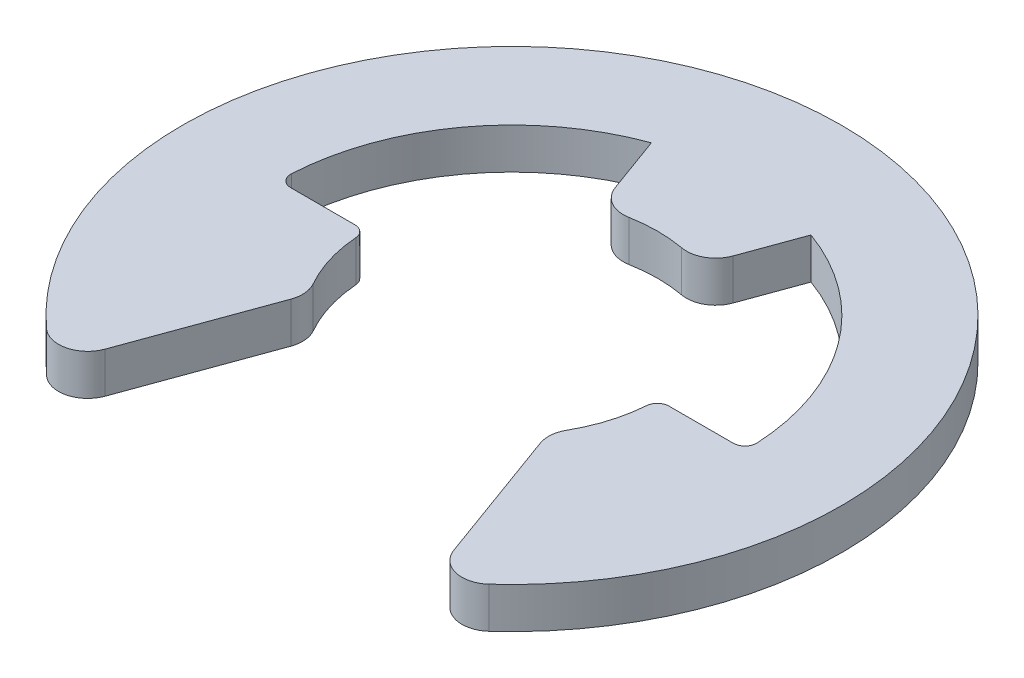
from build123d import *

# Parameters (mm, degrees)
BOSS_EXTRUDE1_DEPTH = 0.35
FILLET1_R           = 0.5
FILLET2_R           = 0.2


with BuildPart() as part:
    # Sketch2 → Boss-Extrude1 (new, symmetric)
    with BuildSketch(Plane(origin=(0, 0, 0), x_dir=(1, 0, 0), z_dir=(0, 1, 0))):
        with BuildLine():
            Line((-3.225261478, -4.638985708), (-2.055, -1.423718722))
            ThreePointArc((-2.055, -1.423718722), (-2.386158, -0.745821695), (-2.5, 0))
            Line((-2.5, 0), (-4, 0))
            ThreePointArc((-4, 0), (-3.276608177, 2.294305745), (-1.368080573, 3.758770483))
            Line((-1.368080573, 3.758770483), (-0.855050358, 2.349231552))
            ThreePointArc((-0.855050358, 2.349231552), (0, 2.5), (0.855050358, 2.349231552))
            Line((0.855050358, 2.349231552), (1.368080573, 3.758770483))
            ThreePointArc((1.368080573, 3.758770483), (3.276608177, 2.294305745), (4, 0))
            Line((4, 0), (2.5, 0))
            ThreePointArc((2.5, 0), (2.386158, -0.745821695), (2.055, -1.423718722))
            Line((2.055, -1.423718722), (3.225261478, -4.638985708))
            ThreePointArc((3.225261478, -4.638985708), (0, 5.65), (-3.225261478, -4.638985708))
        make_face()
    extrude(amount=BOSS_EXTRUDE1_DEPTH, both=True)

    # Fillet1
    fillet1_edges = [part.edges().sort_by_distance(p)[0] for p in [
        (-2.055, 0, 1.423718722),
        (-3.225261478, 0, 4.638985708),
        (3.225261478, 0, 4.638985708),
        (2.055, 0, 1.423718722),
        (0.855050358, 0, -2.349231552),
        (-0.855050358, 0, -2.349231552),
    ]]
    fillet(fillet1_edges, radius=FILLET1_R)

    # Fillet2
    fillet2_edges = [part.edges().sort_by_distance(p)[0] for p in [
        (-4, 0, 0),
        (-2.5, 0, 0),
        (2.5, 0, 0),
        (4, 0, 0),
    ]]
    fillet(fillet2_edges, radius=FILLET2_R)


solid = part.part
